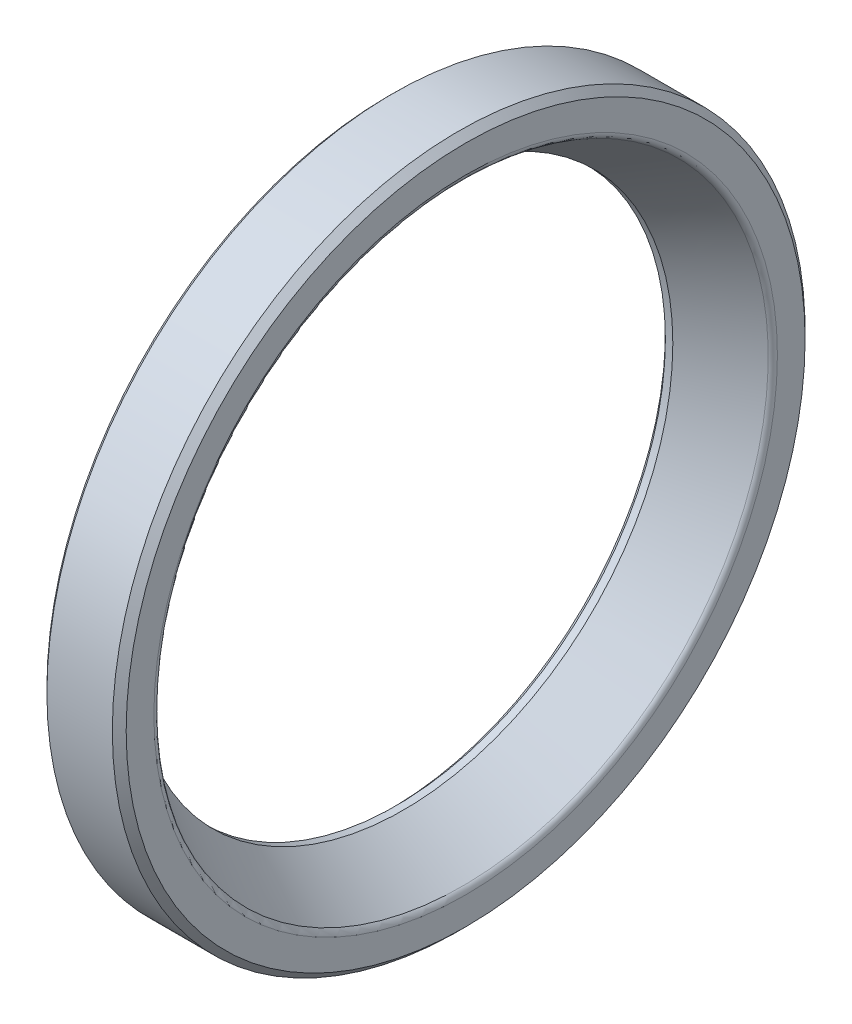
ISO-10303-21;
HEADER;
FILE_DESCRIPTION(('STEP AP214'),'2;1');
FILE_NAME('part.step','',(''),(''),'','','');
FILE_SCHEMA(('AUTOMOTIVE_DESIGN { 1 0 10303 214 1 1 1 1 }'));
ENDSEC;
DATA;
#1=APPLICATION_CONTEXT('core data for automotive mechanical design processes');
#2=APPLICATION_PROTOCOL_DEFINITION('international standard','automotive_design',2000,#1);
#3=PRODUCT_CONTEXT('',#1,'mechanical');
#4=PRODUCT('Part','Part','',(#3));
#5=PRODUCT_RELATED_PRODUCT_CATEGORY('part','',(#4));
#6=PRODUCT_DEFINITION_FORMATION('','',#4);
#7=PRODUCT_DEFINITION_CONTEXT('part definition',#1,'design');
#8=PRODUCT_DEFINITION('design','',#6,#7);
#9=PRODUCT_DEFINITION_SHAPE('','',#8);
#10=(LENGTH_UNIT() NAMED_UNIT(*) SI_UNIT(.MILLI.,.METRE.));
#11=(NAMED_UNIT(*) PLANE_ANGLE_UNIT() SI_UNIT($,.RADIAN.));
#12=(NAMED_UNIT(*) SI_UNIT($,.STERADIAN.) SOLID_ANGLE_UNIT());
#13=UNCERTAINTY_MEASURE_WITH_UNIT(LENGTH_MEASURE(1.E-05),#10,'distance_accuracy_value','');
#14=(GEOMETRIC_REPRESENTATION_CONTEXT(3) GLOBAL_UNCERTAINTY_ASSIGNED_CONTEXT((#13)) GLOBAL_UNIT_ASSIGNED_CONTEXT((#10,
#11,#12)) REPRESENTATION_CONTEXT('',''));
#15=CARTESIAN_POINT('',(0.,0.,0.));
#16=DIRECTION('',(0.,0.,1.));
#17=DIRECTION('',(1.,0.,0.));
#18=AXIS2_PLACEMENT_3D('',#15,#16,#17);
#19=CARTESIAN_POINT('',(0.6,0.,0.));
#20=DIRECTION('',(1.,0.,0.));
#21=DIRECTION('',(0.,0.,-1.));
#22=AXIS2_PLACEMENT_3D('',#19,#20,#21);
#23=CONICAL_SURFACE('',#22,45.,0.785398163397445);
#24=CARTESIAN_POINT('',(0.,0.,0.));
#25=DIRECTION('',(-1.,0.,0.));
#26=DIRECTION('',(0.,0.,1.));
#27=AXIS2_PLACEMENT_3D('',#24,#25,#26);
#28=CIRCLE('',#27,44.4);
#29=CARTESIAN_POINT('',(0.,0.,44.4));
#30=VERTEX_POINT('',#29);
#31=EDGE_CURVE('E87',#30,#30,#28,.T.);
#32=ORIENTED_EDGE('',*,*,#31,.F.);
#33=EDGE_LOOP('',(#32));
#34=FACE_BOUND('',#33,.T.);
#35=CARTESIAN_POINT('',(0.6,0.,0.));
#36=DIRECTION('',(-1.,0.,0.));
#37=DIRECTION('',(0.,0.,1.));
#38=AXIS2_PLACEMENT_3D('',#35,#36,#37);
#39=CIRCLE('',#38,45.);
#40=CARTESIAN_POINT('',(0.6,0.,45.));
#41=VERTEX_POINT('',#40);
#42=EDGE_CURVE('E10',#41,#41,#39,.T.);
#43=ORIENTED_EDGE('',*,*,#42,.T.);
#44=EDGE_LOOP('',(#43));
#45=FACE_BOUND('',#44,.T.);
#46=ADVANCED_FACE('F29',(#34,#45),#23,.T.);
#47=CARTESIAN_POINT('',(10.,0.,0.));
#48=DIRECTION('',(-1.,0.,0.));
#49=DIRECTION('',(0.,0.,1.));
#50=AXIS2_PLACEMENT_3D('',#47,#48,#49);
#51=CYLINDRICAL_SURFACE('',#50,45.);
#52=ORIENTED_EDGE('',*,*,#42,.F.);
#53=EDGE_LOOP('',(#52));
#54=FACE_BOUND('',#53,.T.);
#55=CARTESIAN_POINT('',(9.1,0.,0.));
#56=DIRECTION('',(-1.,0.,0.));
#57=DIRECTION('',(0.,0.,1.));
#58=AXIS2_PLACEMENT_3D('',#55,#56,#57);
#59=CIRCLE('',#58,45.);
#60=CARTESIAN_POINT('',(9.1,0.,45.));
#61=VERTEX_POINT('',#60);
#62=EDGE_CURVE('E35',#61,#61,#59,.T.);
#63=ORIENTED_EDGE('',*,*,#62,.T.);
#64=EDGE_LOOP('',(#63));
#65=FACE_BOUND('',#64,.T.);
#66=ADVANCED_FACE('F94',(#54,#65),#51,.T.);
#67=CARTESIAN_POINT('',(10.,0.,0.));
#68=DIRECTION('',(-1.,0.,0.));
#69=DIRECTION('',(0.,0.,1.));
#70=AXIS2_PLACEMENT_3D('',#67,#68,#69);
#71=CONICAL_SURFACE('',#70,44.1,0.785398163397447);
#72=ORIENTED_EDGE('',*,*,#62,.F.);
#73=EDGE_LOOP('',(#72));
#74=FACE_BOUND('',#73,.T.);
#75=CARTESIAN_POINT('',(10.,0.,0.));
#76=DIRECTION('',(-1.,0.,0.));
#77=DIRECTION('',(0.,0.,1.));
#78=AXIS2_PLACEMENT_3D('',#75,#76,#77);
#79=CIRCLE('',#78,44.1);
#80=CARTESIAN_POINT('',(10.,0.,44.1));
#81=VERTEX_POINT('',#80);
#82=EDGE_CURVE('E39',#81,#81,#79,.T.);
#83=ORIENTED_EDGE('',*,*,#82,.T.);
#84=EDGE_LOOP('',(#83));
#85=FACE_BOUND('',#84,.T.);
#86=ADVANCED_FACE('F98',(#74,#85),#71,.T.);
#87=CARTESIAN_POINT('',(10.,40.501559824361,0.));
#88=DIRECTION('',(-1.,0.,0.));
#89=DIRECTION('',(0.,0.,1.));
#90=AXIS2_PLACEMENT_3D('',#87,#88,#89);
#91=PLANE('',#90);
#92=ORIENTED_EDGE('',*,*,#82,.F.);
#93=EDGE_LOOP('',(#92));
#94=FACE_BOUND('',#93,.T.);
#95=CARTESIAN_POINT('',(10.,0.,0.));
#96=DIRECTION('',(-1.,0.,0.));
#97=DIRECTION('',(0.,0.,1.));
#98=AXIS2_PLACEMENT_3D('',#95,#96,#97);
#99=CIRCLE('',#98,40.501559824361);
#100=CARTESIAN_POINT('',(10.,0.,40.501559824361));
#101=VERTEX_POINT('',#100);
#102=EDGE_CURVE('E43',#101,#101,#99,.T.);
#103=ORIENTED_EDGE('',*,*,#102,.T.);
#104=EDGE_LOOP('',(#103));
#105=FACE_BOUND('',#104,.T.);
#106=ADVANCED_FACE('F103',(#94,#105),#91,.F.);
#107=CARTESIAN_POINT('',(9.09999999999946,0.,0.));
#108=DIRECTION('',(-1.,0.,0.));
#109=DIRECTION('',(0.,0.,1.));
#110=AXIS2_PLACEMENT_3D('',#107,#108,#109);
#111=TOROIDAL_SURFACE('',#110,40.5015598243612,0.900000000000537);
#112=ORIENTED_EDGE('',*,*,#102,.F.);
#113=EDGE_LOOP('',(#112));
#114=FACE_BOUND('',#113,.T.);
#115=CARTESIAN_POINT('',(9.573447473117,0.,0.));
#116=DIRECTION('',(-1.,0.,0.));
#117=DIRECTION('',(0.,0.,1.));
#118=AXIS2_PLACEMENT_3D('',#115,#116,#117);
#119=CIRCLE('',#118,39.736153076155);
#120=CARTESIAN_POINT('',(9.573447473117,0.,39.736153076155));
#121=VERTEX_POINT('',#120);
#122=EDGE_CURVE('E48',#121,#121,#119,.T.);
#123=ORIENTED_EDGE('',*,*,#122,.T.);
#124=EDGE_LOOP('',(#123));
#125=FACE_BOUND('',#124,.T.);
#126=ADVANCED_FACE('F109',(#114,#125),#111,.T.);
#127=CARTESIAN_POINT('',(1.9166666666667,0.,0.));
#128=DIRECTION('',(1.,0.,0.));
#129=DIRECTION('',(0.,0.,-1.));
#130=AXIS2_PLACEMENT_3D('',#127,#128,#129);
#131=CONICAL_SURFACE('',#130,35.,0.553952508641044);
#132=ORIENTED_EDGE('',*,*,#122,.F.);
#133=EDGE_LOOP('',(#132));
#134=FACE_BOUND('',#133,.T.);
#135=CARTESIAN_POINT('',(1.9166666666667,0.,0.));
#136=DIRECTION('',(-1.,0.,0.));
#137=DIRECTION('',(0.,0.,1.));
#138=AXIS2_PLACEMENT_3D('',#135,#136,#137);
#139=CIRCLE('',#138,35.);
#140=CARTESIAN_POINT('',(1.9166666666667,0.,35.));
#141=VERTEX_POINT('',#140);
#142=EDGE_CURVE('E51',#141,#141,#139,.T.);
#143=ORIENTED_EDGE('',*,*,#142,.T.);
#144=EDGE_LOOP('',(#143));
#145=FACE_BOUND('',#144,.T.);
#146=ADVANCED_FACE('F113',(#134,#145),#131,.F.);
#147=CARTESIAN_POINT('',(10.,0.,0.));
#148=DIRECTION('',(-1.,0.,0.));
#149=DIRECTION('',(0.,0.,1.));
#150=AXIS2_PLACEMENT_3D('',#147,#148,#149);
#151=CYLINDRICAL_SURFACE('',#150,35.);
#152=ORIENTED_EDGE('',*,*,#142,.F.);
#153=EDGE_LOOP('',(#152));
#154=FACE_BOUND('',#153,.T.);
#155=CARTESIAN_POINT('',(0.95,0.,0.));
#156=DIRECTION('',(-1.,0.,0.));
#157=DIRECTION('',(0.,0.,1.));
#158=AXIS2_PLACEMENT_3D('',#155,#156,#157);
#159=CIRCLE('',#158,35.);
#160=CARTESIAN_POINT('',(0.95,0.,35.));
#161=VERTEX_POINT('',#160);
#162=EDGE_CURVE('E54',#161,#161,#159,.T.);
#163=ORIENTED_EDGE('',*,*,#162,.T.);
#164=EDGE_LOOP('',(#163));
#165=FACE_BOUND('',#164,.T.);
#166=ADVANCED_FACE('F117',(#154,#165),#151,.F.);
#167=CARTESIAN_POINT('',(0.25,0.,0.));
#168=DIRECTION('',(-1.,0.,0.));
#169=DIRECTION('',(0.,0.,1.));
#170=AXIS2_PLACEMENT_3D('',#167,#168,#169);
#171=CONICAL_SURFACE('',#170,35.7,0.785398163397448);
#172=ORIENTED_EDGE('',*,*,#162,.F.);
#173=EDGE_LOOP('',(#172));
#174=FACE_BOUND('',#173,.T.);
#175=CARTESIAN_POINT('',(0.25,0.,0.));
#176=DIRECTION('',(-1.,0.,0.));
#177=DIRECTION('',(0.,0.,1.));
#178=AXIS2_PLACEMENT_3D('',#175,#176,#177);
#179=CIRCLE('',#178,35.7);
#180=CARTESIAN_POINT('',(0.25,0.,35.7));
#181=VERTEX_POINT('',#180);
#182=EDGE_CURVE('E57',#181,#181,#179,.T.);
#183=ORIENTED_EDGE('',*,*,#182,.T.);
#184=EDGE_LOOP('',(#183));
#185=FACE_BOUND('',#184,.T.);
#186=ADVANCED_FACE('F121',(#174,#185),#171,.F.);
#187=CARTESIAN_POINT('',(0.25,37.5,0.));
#188=DIRECTION('',(1.,0.,0.));
#189=DIRECTION('',(0.,0.,-1.));
#190=AXIS2_PLACEMENT_3D('',#187,#188,#189);
#191=PLANE('',#190);
#192=ORIENTED_EDGE('',*,*,#182,.F.);
#193=EDGE_LOOP('',(#192));
#194=FACE_BOUND('',#193,.T.);
#195=CARTESIAN_POINT('',(0.25,0.,0.));
#196=DIRECTION('',(-1.,0.,0.));
#197=DIRECTION('',(0.,0.,1.));
#198=AXIS2_PLACEMENT_3D('',#195,#196,#197);
#199=CIRCLE('',#198,37.5);
#200=CARTESIAN_POINT('',(0.25,0.,37.5));
#201=VERTEX_POINT('',#200);
#202=EDGE_CURVE('E60',#201,#201,#199,.T.);
#203=ORIENTED_EDGE('',*,*,#202,.T.);
#204=EDGE_LOOP('',(#203));
#205=FACE_BOUND('',#204,.T.);
#206=ADVANCED_FACE('F125',(#194,#205),#191,.F.);
#207=CARTESIAN_POINT('',(10.,0.,0.));
#208=DIRECTION('',(-1.,0.,0.));
#209=DIRECTION('',(0.,0.,1.));
#210=AXIS2_PLACEMENT_3D('',#207,#208,#209);
#211=CYLINDRICAL_SURFACE('',#210,37.5);
#212=ORIENTED_EDGE('',*,*,#202,.F.);
#213=EDGE_LOOP('',(#212));
#214=FACE_BOUND('',#213,.T.);
#215=CARTESIAN_POINT('',(1.3576496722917,0.,0.));
#216=DIRECTION('',(-1.,0.,0.));
#217=DIRECTION('',(0.,0.,1.));
#218=AXIS2_PLACEMENT_3D('',#215,#216,#217);
#219=CIRCLE('',#218,37.5);
#220=CARTESIAN_POINT('',(1.3576496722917,0.,37.5));
#221=VERTEX_POINT('',#220);
#222=EDGE_CURVE('E63',#221,#221,#219,.T.);
#223=ORIENTED_EDGE('',*,*,#222,.T.);
#224=EDGE_LOOP('',(#223));
#225=FACE_BOUND('',#224,.T.);
#226=ADVANCED_FACE('F129',(#214,#225),#211,.T.);
#227=CARTESIAN_POINT('',(1.91666666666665,0.,0.));
#228=DIRECTION('',(-1.,0.,0.));
#229=DIRECTION('',(0.,0.,1.));
#230=AXIS2_PLACEMENT_3D('',#227,#228,#229);
#231=TOROIDAL_SURFACE('',#230,37.,0.750000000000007);
#232=ORIENTED_EDGE('',*,*,#222,.F.);
#233=EDGE_LOOP('',(#232));
#234=FACE_BOUND('',#233,.T.);
#235=CARTESIAN_POINT('',(2.4756836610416,0.,0.));
#236=DIRECTION('',(-1.,0.,0.));
#237=DIRECTION('',(0.,0.,1.));
#238=AXIS2_PLACEMENT_3D('',#235,#236,#237);
#239=CIRCLE('',#238,37.5);
#240=CARTESIAN_POINT('',(2.4756836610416,0.,37.5));
#241=VERTEX_POINT('',#240);
#242=EDGE_CURVE('E66',#241,#241,#239,.T.);
#243=ORIENTED_EDGE('',*,*,#242,.T.);
#244=EDGE_LOOP('',(#243));
#245=FACE_BOUND('',#244,.T.);
#246=ADVANCED_FACE('F133',(#234,#245),#231,.T.);
#247=CARTESIAN_POINT('',(6.9483644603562,0.,0.));
#248=DIRECTION('',(1.,0.,0.));
#249=DIRECTION('',(0.,0.,-1.));
#250=AXIS2_PLACEMENT_3D('',#247,#248,#249);
#251=CONICAL_SURFACE('',#250,39.971467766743,0.504813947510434);
#252=ORIENTED_EDGE('',*,*,#242,.F.);
#253=EDGE_LOOP('',(#252));
#254=FACE_BOUND('',#253,.T.);
#255=CARTESIAN_POINT('',(6.9483644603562,0.,0.));
#256=DIRECTION('',(-1.,0.,0.));
#257=DIRECTION('',(0.,0.,1.));
#258=AXIS2_PLACEMENT_3D('',#255,#256,#257);
#259=CIRCLE('',#258,39.971467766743);
#260=CARTESIAN_POINT('',(6.9483644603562,0.,39.971467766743));
#261=VERTEX_POINT('',#260);
#262=EDGE_CURVE('E69',#261,#261,#259,.T.);
#263=ORIENTED_EDGE('',*,*,#262,.T.);
#264=EDGE_LOOP('',(#263));
#265=FACE_BOUND('',#264,.T.);
#266=ADVANCED_FACE('F137',(#254,#265),#251,.T.);
#267=CARTESIAN_POINT('',(6.89999999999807,0.,0.));
#268=DIRECTION('',(-1.,0.,0.));
#269=DIRECTION('',(0.,0.,1.));
#270=AXIS2_PLACEMENT_3D('',#267,#268,#269);
#271=TOROIDAL_SURFACE('',#270,40.0589942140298,0.100000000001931);
#272=ORIENTED_EDGE('',*,*,#262,.F.);
#273=EDGE_LOOP('',(#272));
#274=FACE_BOUND('',#273,.T.);
#275=CARTESIAN_POINT('',(7.,0.,0.));
#276=DIRECTION('',(-1.,0.,0.));
#277=DIRECTION('',(0.,0.,1.));
#278=AXIS2_PLACEMENT_3D('',#275,#276,#277);
#279=CIRCLE('',#278,40.058994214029);
#280=CARTESIAN_POINT('',(7.,0.,40.058994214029));
#281=VERTEX_POINT('',#280);
#282=EDGE_CURVE('E72',#281,#281,#279,.T.);
#283=ORIENTED_EDGE('',*,*,#282,.T.);
#284=EDGE_LOOP('',(#283));
#285=FACE_BOUND('',#284,.T.);
#286=ADVANCED_FACE('F141',(#274,#285),#271,.F.);
#287=CARTESIAN_POINT('',(7.,42.072727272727,0.));
#288=DIRECTION('',(1.,0.,0.));
#289=DIRECTION('',(0.,0.,-1.));
#290=AXIS2_PLACEMENT_3D('',#287,#288,#289);
#291=PLANE('',#290);
#292=ORIENTED_EDGE('',*,*,#282,.F.);
#293=EDGE_LOOP('',(#292));
#294=FACE_BOUND('',#293,.T.);
#295=CARTESIAN_POINT('',(7.,0.,0.));
#296=DIRECTION('',(-1.,0.,0.));
#297=DIRECTION('',(0.,0.,1.));
#298=AXIS2_PLACEMENT_3D('',#295,#296,#297);
#299=CIRCLE('',#298,42.072727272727);
#300=CARTESIAN_POINT('',(7.,0.,42.072727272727));
#301=VERTEX_POINT('',#300);
#302=EDGE_CURVE('E75',#301,#301,#299,.T.);
#303=ORIENTED_EDGE('',*,*,#302,.T.);
#304=EDGE_LOOP('',(#303));
#305=FACE_BOUND('',#304,.T.);
#306=ADVANCED_FACE('F145',(#294,#305),#291,.F.);
#307=CARTESIAN_POINT('',(6.80000000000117,0.,0.));
#308=DIRECTION('',(-1.,0.,0.));
#309=DIRECTION('',(0.,0.,1.));
#310=AXIS2_PLACEMENT_3D('',#307,#308,#309);
#311=TOROIDAL_SURFACE('',#310,42.0727272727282,0.199999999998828);
#312=ORIENTED_EDGE('',*,*,#302,.F.);
#313=EDGE_LOOP('',(#312));
#314=FACE_BOUND('',#313,.T.);
#315=CARTESIAN_POINT('',(6.8,0.,0.));
#316=DIRECTION('',(-1.,0.,0.));
#317=DIRECTION('',(0.,0.,1.));
#318=AXIS2_PLACEMENT_3D('',#315,#316,#317);
#319=CIRCLE('',#318,42.272727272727);
#320=CARTESIAN_POINT('',(6.8,0.,42.272727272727));
#321=VERTEX_POINT('',#320);
#322=EDGE_CURVE('E78',#321,#321,#319,.T.);
#323=ORIENTED_EDGE('',*,*,#322,.T.);
#324=EDGE_LOOP('',(#323));
#325=FACE_BOUND('',#324,.T.);
#326=ADVANCED_FACE('F149',(#314,#325),#311,.F.);
#327=CARTESIAN_POINT('',(10.,0.,0.));
#328=DIRECTION('',(-1.,0.,0.));
#329=DIRECTION('',(0.,0.,1.));
#330=AXIS2_PLACEMENT_3D('',#327,#328,#329);
#331=CYLINDRICAL_SURFACE('',#330,42.272727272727);
#332=ORIENTED_EDGE('',*,*,#322,.F.);
#333=EDGE_LOOP('',(#332));
#334=FACE_BOUND('',#333,.T.);
#335=CARTESIAN_POINT('',(0.6,0.,0.));
#336=DIRECTION('',(-1.,0.,0.));
#337=DIRECTION('',(0.,0.,1.));
#338=AXIS2_PLACEMENT_3D('',#335,#336,#337);
#339=CIRCLE('',#338,42.272727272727);
#340=CARTESIAN_POINT('',(0.6,0.,42.272727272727));
#341=VERTEX_POINT('',#340);
#342=EDGE_CURVE('E81',#341,#341,#339,.T.);
#343=ORIENTED_EDGE('',*,*,#342,.T.);
#344=EDGE_LOOP('',(#343));
#345=FACE_BOUND('',#344,.T.);
#346=ADVANCED_FACE('F153',(#334,#345),#331,.F.);
#347=CARTESIAN_POINT('',(0.,0.,0.));
#348=DIRECTION('',(-1.,0.,0.));
#349=DIRECTION('',(0.,0.,1.));
#350=AXIS2_PLACEMENT_3D('',#347,#348,#349);
#351=CONICAL_SURFACE('',#350,42.872727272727,0.785398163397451);
#352=ORIENTED_EDGE('',*,*,#342,.F.);
#353=EDGE_LOOP('',(#352));
#354=FACE_BOUND('',#353,.T.);
#355=CARTESIAN_POINT('',(0.,0.,0.));
#356=DIRECTION('',(-1.,0.,0.));
#357=DIRECTION('',(0.,0.,1.));
#358=AXIS2_PLACEMENT_3D('',#355,#356,#357);
#359=CIRCLE('',#358,42.872727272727);
#360=CARTESIAN_POINT('',(0.,0.,42.872727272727));
#361=VERTEX_POINT('',#360);
#362=EDGE_CURVE('E84',#361,#361,#359,.T.);
#363=ORIENTED_EDGE('',*,*,#362,.T.);
#364=EDGE_LOOP('',(#363));
#365=FACE_BOUND('',#364,.T.);
#366=ADVANCED_FACE('F157',(#354,#365),#351,.F.);
#367=CARTESIAN_POINT('',(0.,44.4,0.));
#368=DIRECTION('',(1.,0.,0.));
#369=DIRECTION('',(0.,0.,-1.));
#370=AXIS2_PLACEMENT_3D('',#367,#368,#369);
#371=PLANE('',#370);
#372=ORIENTED_EDGE('',*,*,#362,.F.);
#373=EDGE_LOOP('',(#372));
#374=FACE_BOUND('',#373,.T.);
#375=ORIENTED_EDGE('',*,*,#31,.T.);
#376=EDGE_LOOP('',(#375));
#377=FACE_BOUND('',#376,.T.);
#378=ADVANCED_FACE('F91',(#374,#377),#371,.F.);
#379=CLOSED_SHELL('',(#46,#66,#86,#106,#126,#146,#166,#186,#206,#226,#246,#266,#286,#306,#326,
#346,#366,#378));
#380=MANIFOLD_SOLID_BREP('B2',#379);
#381=ADVANCED_BREP_SHAPE_REPRESENTATION('',(#18,#380),#14);
#382=SHAPE_DEFINITION_REPRESENTATION(#9,#381);
ENDSEC;
END-ISO-10303-21;
